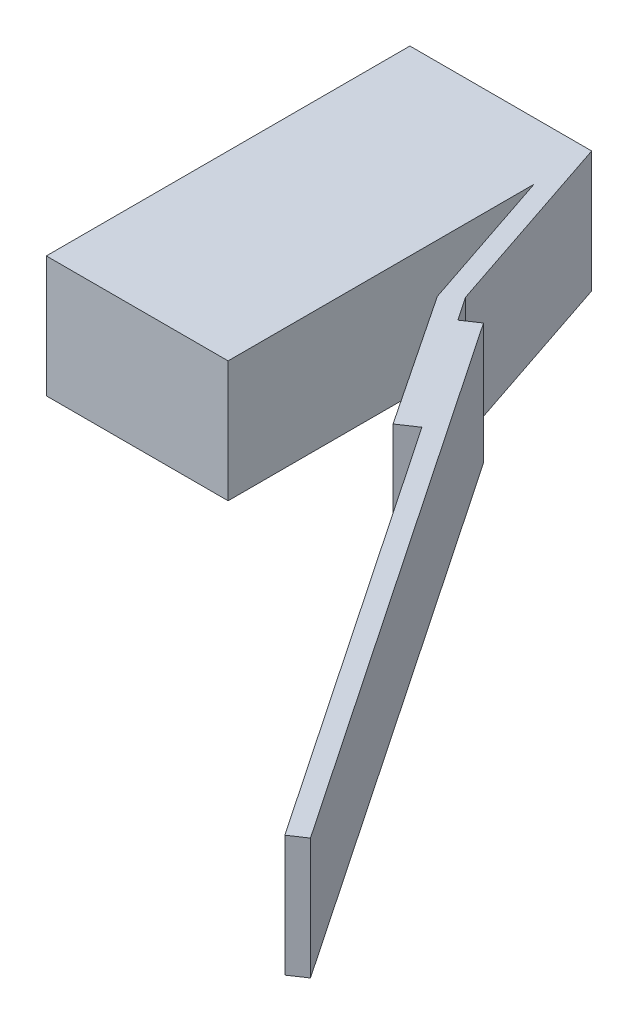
ISO-10303-21;
HEADER;
FILE_DESCRIPTION(('STEP AP214'),'2;1');
FILE_NAME('part.step','',(''),(''),'','','');
FILE_SCHEMA(('AUTOMOTIVE_DESIGN { 1 0 10303 214 1 1 1 1 }'));
ENDSEC;
DATA;
#1=APPLICATION_CONTEXT('core data for automotive mechanical design processes');
#2=APPLICATION_PROTOCOL_DEFINITION('international standard','automotive_design',2000,#1);
#3=PRODUCT_CONTEXT('',#1,'mechanical');
#4=PRODUCT('Part','Part','',(#3));
#5=PRODUCT_RELATED_PRODUCT_CATEGORY('part','',(#4));
#6=PRODUCT_DEFINITION_FORMATION('','',#4);
#7=PRODUCT_DEFINITION_CONTEXT('part definition',#1,'design');
#8=PRODUCT_DEFINITION('design','',#6,#7);
#9=PRODUCT_DEFINITION_SHAPE('','',#8);
#10=(LENGTH_UNIT() NAMED_UNIT(*) SI_UNIT(.MILLI.,.METRE.));
#11=(NAMED_UNIT(*) PLANE_ANGLE_UNIT() SI_UNIT($,.RADIAN.));
#12=(NAMED_UNIT(*) SI_UNIT($,.STERADIAN.) SOLID_ANGLE_UNIT());
#13=UNCERTAINTY_MEASURE_WITH_UNIT(LENGTH_MEASURE(1.E-05),#10,'distance_accuracy_value','');
#14=(GEOMETRIC_REPRESENTATION_CONTEXT(3) GLOBAL_UNCERTAINTY_ASSIGNED_CONTEXT((#13)) GLOBAL_UNIT_ASSIGNED_CONTEXT((#10,
#11,#12)) REPRESENTATION_CONTEXT('',''));
#15=CARTESIAN_POINT('',(0.,0.,0.));
#16=DIRECTION('',(0.,0.,1.));
#17=DIRECTION('',(1.,0.,0.));
#18=AXIS2_PLACEMENT_3D('',#15,#16,#17);
#19=CARTESIAN_POINT('',(9.525,6.35,0.));
#20=DIRECTION('',(0.,0.,-1.));
#21=DIRECTION('',(-1.,0.,0.));
#22=AXIS2_PLACEMENT_3D('',#19,#20,#21);
#23=PLANE('',#22);
#24=DIRECTION('',(1.,0.,0.));
#25=VECTOR('',#24,1.);
#26=CARTESIAN_POINT('',(9.525,0.,0.));
#27=LINE('',#26,#25);
#28=CARTESIAN_POINT('',(0.,0.,0.));
#29=VERTEX_POINT('',#28);
#30=CARTESIAN_POINT('',(9.525,0.,0.));
#31=VERTEX_POINT('',#30);
#32=EDGE_CURVE('E157',#29,#31,#27,.T.);
#33=ORIENTED_EDGE('',*,*,#32,.T.);
#34=DIRECTION('',(0.,-1.,0.));
#35=VECTOR('',#34,1.);
#36=CARTESIAN_POINT('',(9.525,6.35,0.));
#37=LINE('',#36,#35);
#38=CARTESIAN_POINT('',(9.525,6.35,0.));
#39=VERTEX_POINT('',#38);
#40=EDGE_CURVE('E11',#39,#31,#37,.T.);
#41=ORIENTED_EDGE('',*,*,#40,.F.);
#42=DIRECTION('',(1.,0.,0.));
#43=VECTOR('',#42,1.);
#44=CARTESIAN_POINT('',(9.525,6.35,0.));
#45=LINE('',#44,#43);
#46=CARTESIAN_POINT('',(0.,6.35,0.));
#47=VERTEX_POINT('',#46);
#48=EDGE_CURVE('E181',#47,#39,#45,.T.);
#49=ORIENTED_EDGE('',*,*,#48,.F.);
#50=DIRECTION('',(0.,-1.,0.));
#51=VECTOR('',#50,1.);
#52=CARTESIAN_POINT('',(0.,6.35,0.));
#53=LINE('',#52,#51);
#54=EDGE_CURVE('E153',#47,#29,#53,.T.);
#55=ORIENTED_EDGE('',*,*,#54,.T.);
#56=EDGE_LOOP('',(#33,#41,#49,#55));
#57=FACE_BOUND('',#56,.T.);
#58=ADVANCED_FACE('F31',(#57),#23,.F.);
#59=CARTESIAN_POINT('',(9.525,6.35,-16.0282614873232));
#60=DIRECTION('',(-1.,0.,0.));
#61=DIRECTION('',(0.,0.,1.));
#62=AXIS2_PLACEMENT_3D('',#59,#60,#61);
#63=PLANE('',#62);
#64=DIRECTION('',(0.,0.,-1.));
#65=VECTOR('',#64,1.);
#66=CARTESIAN_POINT('',(9.525,0.,-16.0282614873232));
#67=LINE('',#66,#65);
#68=CARTESIAN_POINT('',(9.525,0.,-16.0282614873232));
#69=VERTEX_POINT('',#68);
#70=EDGE_CURVE('E160',#31,#69,#67,.T.);
#71=ORIENTED_EDGE('',*,*,#70,.T.);
#72=DIRECTION('',(0.,-1.,0.));
#73=VECTOR('',#72,1.);
#74=CARTESIAN_POINT('',(9.525,6.35,-16.0282614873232));
#75=LINE('',#74,#73);
#76=CARTESIAN_POINT('',(9.525,6.35,-16.0282614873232));
#77=VERTEX_POINT('',#76);
#78=EDGE_CURVE('E39',#77,#69,#75,.T.);
#79=ORIENTED_EDGE('',*,*,#78,.F.);
#80=DIRECTION('',(0.,0.,-1.));
#81=VECTOR('',#80,1.);
#82=CARTESIAN_POINT('',(9.525,6.35,-16.0282614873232));
#83=LINE('',#82,#81);
#84=EDGE_CURVE('E105',#39,#77,#83,.T.);
#85=ORIENTED_EDGE('',*,*,#84,.F.);
#86=ORIENTED_EDGE('',*,*,#40,.T.);
#87=EDGE_LOOP('',(#71,#79,#85,#86));
#88=FACE_BOUND('',#87,.T.);
#89=ADVANCED_FACE('F264',(#88),#63,.F.);
#90=CARTESIAN_POINT('',(12.0791560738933,6.35,-8.40906175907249));
#91=DIRECTION('',(0.948143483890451,0.,-0.317842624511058));
#92=DIRECTION('',(-0.317842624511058,0.,-0.948143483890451));
#93=AXIS2_PLACEMENT_3D('',#90,#91,#92);
#94=PLANE('',#93);
#95=DIRECTION('',(0.317842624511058,0.,0.948143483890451));
#96=VECTOR('',#95,1.);
#97=CARTESIAN_POINT('',(12.0791560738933,0.,-8.40906175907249));
#98=LINE('',#97,#96);
#99=CARTESIAN_POINT('',(12.0791560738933,0.,-8.40906175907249));
#100=VERTEX_POINT('',#99);
#101=EDGE_CURVE('E162',#69,#100,#98,.T.);
#102=ORIENTED_EDGE('',*,*,#101,.T.);
#103=DIRECTION('',(0.,-1.,0.));
#104=VECTOR('',#103,1.);
#105=CARTESIAN_POINT('',(12.0791560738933,6.35,-8.40906175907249));
#106=LINE('',#105,#104);
#107=CARTESIAN_POINT('',(12.0791560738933,6.35,-8.40906175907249));
#108=VERTEX_POINT('',#107);
#109=EDGE_CURVE('E203',#108,#100,#106,.T.);
#110=ORIENTED_EDGE('',*,*,#109,.F.);
#111=DIRECTION('',(0.317842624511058,0.,0.948143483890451));
#112=VECTOR('',#111,1.);
#113=CARTESIAN_POINT('',(12.0791560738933,6.35,-8.40906175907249));
#114=LINE('',#113,#112);
#115=EDGE_CURVE('E211',#77,#108,#114,.T.);
#116=ORIENTED_EDGE('',*,*,#115,.F.);
#117=ORIENTED_EDGE('',*,*,#78,.T.);
#118=EDGE_LOOP('',(#102,#110,#116,#117));
#119=FACE_BOUND('',#118,.T.);
#120=ADVANCED_FACE('F209',(#119),#94,.F.);
#121=CARTESIAN_POINT('',(16.7102113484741,6.35,-1.4573431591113));
#122=DIRECTION('',(0.832239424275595,0.,-0.554416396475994));
#123=DIRECTION('',(-0.554416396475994,0.,-0.832239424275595));
#124=AXIS2_PLACEMENT_3D('',#121,#122,#123);
#125=PLANE('',#124);
#126=DIRECTION('',(0.554416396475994,0.,0.832239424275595));
#127=VECTOR('',#126,1.);
#128=CARTESIAN_POINT('',(16.7102113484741,0.,-1.4573431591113));
#129=LINE('',#128,#127);
#130=CARTESIAN_POINT('',(16.7102113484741,0.,-1.4573431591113));
#131=VERTEX_POINT('',#130);
#132=EDGE_CURVE('E164',#100,#131,#129,.T.);
#133=ORIENTED_EDGE('',*,*,#132,.T.);
#134=DIRECTION('',(0.,-1.,0.));
#135=VECTOR('',#134,1.);
#136=CARTESIAN_POINT('',(16.7102113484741,6.35,-1.4573431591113));
#137=LINE('',#136,#135);
#138=CARTESIAN_POINT('',(16.7102113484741,6.35,-1.4573431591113));
#139=VERTEX_POINT('',#138);
#140=EDGE_CURVE('E200',#139,#131,#137,.T.);
#141=ORIENTED_EDGE('',*,*,#140,.F.);
#142=DIRECTION('',(0.554416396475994,0.,0.832239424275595));
#143=VECTOR('',#142,1.);
#144=CARTESIAN_POINT('',(16.7102113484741,6.35,-1.4573431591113));
#145=LINE('',#144,#143);
#146=EDGE_CURVE('E229',#108,#139,#145,.T.);
#147=ORIENTED_EDGE('',*,*,#146,.F.);
#148=ORIENTED_EDGE('',*,*,#109,.T.);
#149=EDGE_LOOP('',(#133,#141,#147,#148));
#150=FACE_BOUND('',#149,.T.);
#151=ADVANCED_FACE('F220',(#150),#125,.F.);
#152=CARTESIAN_POINT('',(17.6128594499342,6.35,-2.0666902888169));
#153=DIRECTION('',(-0.559510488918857,0.,-0.828823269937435));
#154=DIRECTION('',(-0.828823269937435,0.,0.559510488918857));
#155=AXIS2_PLACEMENT_3D('',#152,#153,#154);
#156=PLANE('',#155);
#157=DIRECTION('',(0.828823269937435,0.,-0.559510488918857));
#158=VECTOR('',#157,1.);
#159=CARTESIAN_POINT('',(17.6128594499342,0.,-2.0666902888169));
#160=LINE('',#159,#158);
#161=CARTESIAN_POINT('',(17.6128594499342,0.,-2.0666902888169));
#162=VERTEX_POINT('',#161);
#163=EDGE_CURVE('E166',#131,#162,#160,.T.);
#164=ORIENTED_EDGE('',*,*,#163,.T.);
#165=DIRECTION('',(0.,-1.,0.));
#166=VECTOR('',#165,1.);
#167=CARTESIAN_POINT('',(17.6128594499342,6.35,-2.0666902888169));
#168=LINE('',#167,#166);
#169=CARTESIAN_POINT('',(17.6128594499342,6.35,-2.0666902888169));
#170=VERTEX_POINT('',#169);
#171=EDGE_CURVE('E197',#170,#162,#168,.T.);
#172=ORIENTED_EDGE('',*,*,#171,.F.);
#173=DIRECTION('',(0.828823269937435,0.,-0.559510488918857));
#174=VECTOR('',#173,1.);
#175=CARTESIAN_POINT('',(17.6128594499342,6.35,-2.0666902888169));
#176=LINE('',#175,#174);
#177=EDGE_CURVE('E226',#139,#170,#176,.T.);
#178=ORIENTED_EDGE('',*,*,#177,.F.);
#179=ORIENTED_EDGE('',*,*,#140,.T.);
#180=EDGE_LOOP('',(#164,#172,#178,#179));
#181=FACE_BOUND('',#180,.T.);
#182=ADVANCED_FACE('F224',(#181),#156,.F.);
#183=CARTESIAN_POINT('',(32.5339960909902,6.35,20.0365329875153));
#184=DIRECTION('',(0.828823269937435,0.,-0.559510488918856));
#185=DIRECTION('',(-0.559510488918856,0.,-0.828823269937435));
#186=AXIS2_PLACEMENT_3D('',#183,#184,#185);
#187=PLANE('',#186);
#188=DIRECTION('',(0.559510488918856,0.,0.828823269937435));
#189=VECTOR('',#188,1.);
#190=CARTESIAN_POINT('',(32.5339960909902,0.,20.0365329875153));
#191=LINE('',#190,#189);
#192=CARTESIAN_POINT('',(32.5339960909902,0.,20.0365329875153));
#193=VERTEX_POINT('',#192);
#194=EDGE_CURVE('E168',#162,#193,#191,.T.);
#195=ORIENTED_EDGE('',*,*,#194,.T.);
#196=DIRECTION('',(0.,-1.,0.));
#197=VECTOR('',#196,1.);
#198=CARTESIAN_POINT('',(32.5339960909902,6.35,20.0365329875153));
#199=LINE('',#198,#197);
#200=CARTESIAN_POINT('',(32.5339960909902,6.35,20.0365329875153));
#201=VERTEX_POINT('',#200);
#202=EDGE_CURVE('E194',#201,#193,#199,.T.);
#203=ORIENTED_EDGE('',*,*,#202,.F.);
#204=DIRECTION('',(0.559510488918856,0.,0.828823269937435));
#205=VECTOR('',#204,1.);
#206=CARTESIAN_POINT('',(32.5339960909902,6.35,20.0365329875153));
#207=LINE('',#206,#205);
#208=EDGE_CURVE('E228',#170,#201,#207,.T.);
#209=ORIENTED_EDGE('',*,*,#208,.F.);
#210=ORIENTED_EDGE('',*,*,#171,.T.);
#211=EDGE_LOOP('',(#195,#203,#209,#210));
#212=FACE_BOUND('',#211,.T.);
#213=ADVANCED_FACE('F277',(#212),#187,.F.);
#214=CARTESIAN_POINT('',(33.3356066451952,6.35,19.4953928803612));
#215=DIRECTION('',(-0.559510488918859,0.,-0.828823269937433));
#216=DIRECTION('',(-0.828823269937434,0.,0.559510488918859));
#217=AXIS2_PLACEMENT_3D('',#214,#215,#216);
#218=PLANE('',#217);
#219=DIRECTION('',(0.828823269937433,0.,-0.559510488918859));
#220=VECTOR('',#219,1.);
#221=CARTESIAN_POINT('',(33.3356066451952,0.,19.4953928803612));
#222=LINE('',#221,#220);
#223=CARTESIAN_POINT('',(33.3356066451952,0.,19.4953928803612));
#224=VERTEX_POINT('',#223);
#225=EDGE_CURVE('E170',#193,#224,#222,.T.);
#226=ORIENTED_EDGE('',*,*,#225,.T.);
#227=DIRECTION('',(0.,-1.,0.));
#228=VECTOR('',#227,1.);
#229=CARTESIAN_POINT('',(33.3356066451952,6.35,19.4953928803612));
#230=LINE('',#229,#228);
#231=CARTESIAN_POINT('',(33.3356066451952,6.35,19.4953928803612));
#232=VERTEX_POINT('',#231);
#233=EDGE_CURVE('E191',#232,#224,#230,.T.);
#234=ORIENTED_EDGE('',*,*,#233,.F.);
#235=DIRECTION('',(0.828823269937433,0.,-0.559510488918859));
#236=VECTOR('',#235,1.);
#237=CARTESIAN_POINT('',(33.3356066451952,6.35,19.4953928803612));
#238=LINE('',#237,#236);
#239=EDGE_CURVE('E231',#201,#232,#238,.T.);
#240=ORIENTED_EDGE('',*,*,#239,.F.);
#241=ORIENTED_EDGE('',*,*,#202,.T.);
#242=EDGE_LOOP('',(#226,#234,#240,#241));
#243=FACE_BOUND('',#242,.T.);
#244=ADVANCED_FACE('F280',(#243),#218,.F.);
#245=CARTESIAN_POINT('',(14.4982553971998,6.35,-8.40906175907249));
#246=DIRECTION('',(-0.828823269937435,0.,0.559510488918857));
#247=DIRECTION('',(0.559510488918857,0.,0.828823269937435));
#248=AXIS2_PLACEMENT_3D('',#245,#246,#247);
#249=PLANE('',#248);
#250=DIRECTION('',(-0.559510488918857,0.,-0.828823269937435));
#251=VECTOR('',#250,1.);
#252=CARTESIAN_POINT('',(14.4982553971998,0.,-8.40906175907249));
#253=LINE('',#252,#251);
#254=CARTESIAN_POINT('',(14.4982553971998,0.,-8.40906175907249));
#255=VERTEX_POINT('',#254);
#256=EDGE_CURVE('E172',#224,#255,#253,.T.);
#257=ORIENTED_EDGE('',*,*,#256,.T.);
#258=DIRECTION('',(0.,-1.,0.));
#259=VECTOR('',#258,1.);
#260=CARTESIAN_POINT('',(14.4982553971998,6.35,-8.40906175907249));
#261=LINE('',#260,#259);
#262=CARTESIAN_POINT('',(14.4982553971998,6.35,-8.40906175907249));
#263=VERTEX_POINT('',#262);
#264=EDGE_CURVE('E188',#263,#255,#261,.T.);
#265=ORIENTED_EDGE('',*,*,#264,.F.);
#266=DIRECTION('',(-0.559510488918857,0.,-0.828823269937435));
#267=VECTOR('',#266,1.);
#268=CARTESIAN_POINT('',(14.4982553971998,6.35,-8.40906175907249));
#269=LINE('',#268,#267);
#270=EDGE_CURVE('E237',#232,#263,#269,.T.);
#271=ORIENTED_EDGE('',*,*,#270,.F.);
#272=ORIENTED_EDGE('',*,*,#233,.T.);
#273=EDGE_LOOP('',(#257,#265,#271,#272));
#274=FACE_BOUND('',#273,.T.);
#275=ADVANCED_FACE('F284',(#274),#249,.F.);
#276=CARTESIAN_POINT('',(13.6966448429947,6.35,-7.86792165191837));
#277=DIRECTION('',(0.559510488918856,0.,0.828823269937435));
#278=DIRECTION('',(0.828823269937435,0.,-0.559510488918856));
#279=AXIS2_PLACEMENT_3D('',#276,#277,#278);
#280=PLANE('',#279);
#281=DIRECTION('',(-0.828823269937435,0.,0.559510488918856));
#282=VECTOR('',#281,1.);
#283=CARTESIAN_POINT('',(13.6966448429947,0.,-7.86792165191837));
#284=LINE('',#283,#282);
#285=CARTESIAN_POINT('',(13.6966448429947,0.,-7.86792165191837));
#286=VERTEX_POINT('',#285);
#287=EDGE_CURVE('E174',#255,#286,#284,.T.);
#288=ORIENTED_EDGE('',*,*,#287,.T.);
#289=DIRECTION('',(0.,-1.,0.));
#290=VECTOR('',#289,1.);
#291=CARTESIAN_POINT('',(13.6966448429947,6.35,-7.86792165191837));
#292=LINE('',#291,#290);
#293=CARTESIAN_POINT('',(13.6966448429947,6.35,-7.86792165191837));
#294=VERTEX_POINT('',#293);
#295=EDGE_CURVE('E185',#294,#286,#292,.T.);
#296=ORIENTED_EDGE('',*,*,#295,.F.);
#297=DIRECTION('',(-0.828823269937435,0.,0.559510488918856));
#298=VECTOR('',#297,1.);
#299=CARTESIAN_POINT('',(13.6966448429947,6.35,-7.86792165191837));
#300=LINE('',#299,#298);
#301=EDGE_CURVE('E239',#263,#294,#300,.T.);
#302=ORIENTED_EDGE('',*,*,#301,.F.);
#303=ORIENTED_EDGE('',*,*,#264,.T.);
#304=EDGE_LOOP('',(#288,#296,#302,#303));
#305=FACE_BOUND('',#304,.T.);
#306=ADVANCED_FACE('F245',(#305),#280,.F.);
#307=CARTESIAN_POINT('',(12.8561525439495,6.35,-9.11297351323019));
#308=DIRECTION('',(-0.828823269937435,0.,0.559510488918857));
#309=DIRECTION('',(0.559510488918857,0.,0.828823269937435));
#310=AXIS2_PLACEMENT_3D('',#307,#308,#309);
#311=PLANE('',#310);
#312=DIRECTION('',(-0.559510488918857,0.,-0.828823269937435));
#313=VECTOR('',#312,1.);
#314=CARTESIAN_POINT('',(12.8561525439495,0.,-9.11297351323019));
#315=LINE('',#314,#313);
#316=CARTESIAN_POINT('',(12.8561525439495,0.,-9.11297351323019));
#317=VERTEX_POINT('',#316);
#318=EDGE_CURVE('E176',#286,#317,#315,.T.);
#319=ORIENTED_EDGE('',*,*,#318,.T.);
#320=DIRECTION('',(0.,-1.,0.));
#321=VECTOR('',#320,1.);
#322=CARTESIAN_POINT('',(12.8561525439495,6.35,-9.11297351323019));
#323=LINE('',#322,#321);
#324=CARTESIAN_POINT('',(12.8561525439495,6.35,-9.11297351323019));
#325=VERTEX_POINT('',#324);
#326=EDGE_CURVE('E148',#325,#317,#323,.T.);
#327=ORIENTED_EDGE('',*,*,#326,.F.);
#328=DIRECTION('',(-0.559510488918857,0.,-0.828823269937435));
#329=VECTOR('',#328,1.);
#330=CARTESIAN_POINT('',(12.8561525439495,6.35,-9.11297351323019));
#331=LINE('',#330,#329);
#332=EDGE_CURVE('E139',#294,#325,#331,.T.);
#333=ORIENTED_EDGE('',*,*,#332,.F.);
#334=ORIENTED_EDGE('',*,*,#295,.T.);
#335=EDGE_LOOP('',(#319,#327,#333,#334));
#336=FACE_BOUND('',#335,.T.);
#337=ADVANCED_FACE('F249',(#336),#311,.F.);
#338=CARTESIAN_POINT('',(9.525,6.35,-19.05));
#339=DIRECTION('',(-0.948143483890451,0.,0.317842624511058));
#340=DIRECTION('',(0.317842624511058,0.,0.948143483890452));
#341=AXIS2_PLACEMENT_3D('',#338,#339,#340);
#342=PLANE('',#341);
#343=DIRECTION('',(-0.317842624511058,0.,-0.948143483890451));
#344=VECTOR('',#343,1.);
#345=CARTESIAN_POINT('',(9.525,0.,-19.05));
#346=LINE('',#345,#344);
#347=CARTESIAN_POINT('',(9.525,0.,-19.05));
#348=VERTEX_POINT('',#347);
#349=EDGE_CURVE('E147',#317,#348,#346,.T.);
#350=ORIENTED_EDGE('',*,*,#349,.T.);
#351=DIRECTION('',(0.,-1.,0.));
#352=VECTOR('',#351,1.);
#353=CARTESIAN_POINT('',(9.525,6.35,-19.05));
#354=LINE('',#353,#352);
#355=CARTESIAN_POINT('',(9.525,6.35,-19.05));
#356=VERTEX_POINT('',#355);
#357=EDGE_CURVE('E144',#356,#348,#354,.T.);
#358=ORIENTED_EDGE('',*,*,#357,.F.);
#359=DIRECTION('',(-0.317842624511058,0.,-0.948143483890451));
#360=VECTOR('',#359,1.);
#361=CARTESIAN_POINT('',(9.525,6.35,-19.05));
#362=LINE('',#361,#360);
#363=EDGE_CURVE('E133',#325,#356,#362,.T.);
#364=ORIENTED_EDGE('',*,*,#363,.F.);
#365=ORIENTED_EDGE('',*,*,#326,.T.);
#366=EDGE_LOOP('',(#350,#358,#364,#365));
#367=FACE_BOUND('',#366,.T.);
#368=ADVANCED_FACE('F145',(#367),#342,.F.);
#369=CARTESIAN_POINT('',(0.,6.35,-19.05));
#370=DIRECTION('',(0.,0.,1.));
#371=DIRECTION('',(1.,0.,0.));
#372=AXIS2_PLACEMENT_3D('',#369,#370,#371);
#373=PLANE('',#372);
#374=DIRECTION('',(-1.,0.,0.));
#375=VECTOR('',#374,1.);
#376=CARTESIAN_POINT('',(0.,0.,-19.05));
#377=LINE('',#376,#375);
#378=CARTESIAN_POINT('',(0.,0.,-19.05));
#379=VERTEX_POINT('',#378);
#380=EDGE_CURVE('E91',#348,#379,#377,.T.);
#381=ORIENTED_EDGE('',*,*,#380,.T.);
#382=DIRECTION('',(0.,-1.,0.));
#383=VECTOR('',#382,1.);
#384=CARTESIAN_POINT('',(0.,6.35,-19.05));
#385=LINE('',#384,#383);
#386=CARTESIAN_POINT('',(0.,6.35,-19.05));
#387=VERTEX_POINT('',#386);
#388=EDGE_CURVE('E149',#387,#379,#385,.T.);
#389=ORIENTED_EDGE('',*,*,#388,.F.);
#390=DIRECTION('',(-1.,0.,0.));
#391=VECTOR('',#390,1.);
#392=CARTESIAN_POINT('',(0.,6.35,-19.05));
#393=LINE('',#392,#391);
#394=EDGE_CURVE('E137',#356,#387,#393,.T.);
#395=ORIENTED_EDGE('',*,*,#394,.F.);
#396=ORIENTED_EDGE('',*,*,#357,.T.);
#397=EDGE_LOOP('',(#381,#389,#395,#396));
#398=FACE_BOUND('',#397,.T.);
#399=ADVANCED_FACE('F151',(#398),#373,.F.);
#400=CARTESIAN_POINT('',(0.,6.35,0.));
#401=DIRECTION('',(1.,0.,0.));
#402=DIRECTION('',(0.,0.,-1.));
#403=AXIS2_PLACEMENT_3D('',#400,#401,#402);
#404=PLANE('',#403);
#405=DIRECTION('',(0.,0.,1.));
#406=VECTOR('',#405,1.);
#407=CARTESIAN_POINT('',(0.,0.,0.));
#408=LINE('',#407,#406);
#409=EDGE_CURVE('E97',#379,#29,#408,.T.);
#410=ORIENTED_EDGE('',*,*,#409,.T.);
#411=ORIENTED_EDGE('',*,*,#54,.F.);
#412=DIRECTION('',(0.,0.,1.));
#413=VECTOR('',#412,1.);
#414=CARTESIAN_POINT('',(0.,6.35,0.));
#415=LINE('',#414,#413);
#416=EDGE_CURVE('E47',#387,#47,#415,.T.);
#417=ORIENTED_EDGE('',*,*,#416,.F.);
#418=ORIENTED_EDGE('',*,*,#388,.T.);
#419=EDGE_LOOP('',(#410,#411,#417,#418));
#420=FACE_BOUND('',#419,.T.);
#421=ADVANCED_FACE('F253',(#420),#404,.F.);
#422=CARTESIAN_POINT('',(0.,6.35,0.));
#423=DIRECTION('',(0.,-1.,0.));
#424=DIRECTION('',(0.,0.,-1.));
#425=AXIS2_PLACEMENT_3D('',#422,#423,#424);
#426=PLANE('',#425);
#427=ORIENTED_EDGE('',*,*,#48,.T.);
#428=ORIENTED_EDGE('',*,*,#84,.T.);
#429=ORIENTED_EDGE('',*,*,#115,.T.);
#430=ORIENTED_EDGE('',*,*,#146,.T.);
#431=ORIENTED_EDGE('',*,*,#177,.T.);
#432=ORIENTED_EDGE('',*,*,#208,.T.);
#433=ORIENTED_EDGE('',*,*,#239,.T.);
#434=ORIENTED_EDGE('',*,*,#270,.T.);
#435=ORIENTED_EDGE('',*,*,#301,.T.);
#436=ORIENTED_EDGE('',*,*,#332,.T.);
#437=ORIENTED_EDGE('',*,*,#363,.T.);
#438=ORIENTED_EDGE('',*,*,#394,.T.);
#439=ORIENTED_EDGE('',*,*,#416,.T.);
#440=EDGE_LOOP('',(#427,#428,#429,#430,#431,#432,#433,#434,#435,#436,#437,#438,#439));
#441=FACE_BOUND('',#440,.T.);
#442=ADVANCED_FACE('F135',(#441),#426,.F.);
#443=CARTESIAN_POINT('',(0.,0.,0.));
#444=DIRECTION('',(0.,-1.,0.));
#445=DIRECTION('',(0.,0.,-1.));
#446=AXIS2_PLACEMENT_3D('',#443,#444,#445);
#447=PLANE('',#446);
#448=ORIENTED_EDGE('',*,*,#32,.F.);
#449=ORIENTED_EDGE('',*,*,#409,.F.);
#450=ORIENTED_EDGE('',*,*,#380,.F.);
#451=ORIENTED_EDGE('',*,*,#349,.F.);
#452=ORIENTED_EDGE('',*,*,#318,.F.);
#453=ORIENTED_EDGE('',*,*,#287,.F.);
#454=ORIENTED_EDGE('',*,*,#256,.F.);
#455=ORIENTED_EDGE('',*,*,#225,.F.);
#456=ORIENTED_EDGE('',*,*,#194,.F.);
#457=ORIENTED_EDGE('',*,*,#163,.F.);
#458=ORIENTED_EDGE('',*,*,#132,.F.);
#459=ORIENTED_EDGE('',*,*,#101,.F.);
#460=ORIENTED_EDGE('',*,*,#70,.F.);
#461=EDGE_LOOP('',(#448,#449,#450,#451,#452,#453,#454,#455,#456,#457,#458,#459,#460));
#462=FACE_BOUND('',#461,.T.);
#463=ADVANCED_FACE('F215',(#462),#447,.T.);
#464=CLOSED_SHELL('',(#58,#89,#120,#151,#182,#213,#244,#275,#306,#337,#368,#399,#421,#442,#463));
#465=MANIFOLD_SOLID_BREP('B2',#464);
#466=ADVANCED_BREP_SHAPE_REPRESENTATION('',(#18,#465),#14);
#467=SHAPE_DEFINITION_REPRESENTATION(#9,#466);
ENDSEC;
END-ISO-10303-21;
